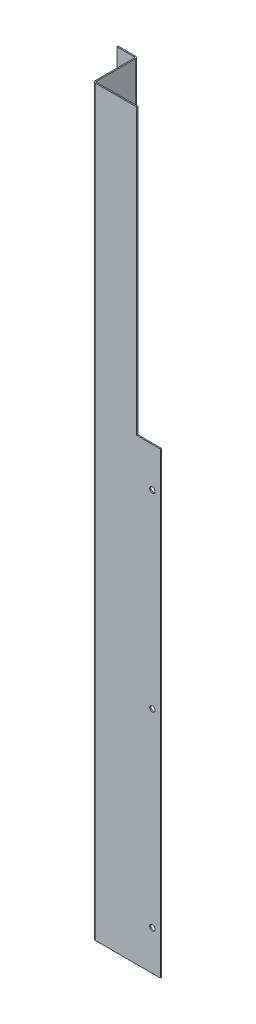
ISO-10303-21;
HEADER;
FILE_DESCRIPTION(('STEP AP214'),'2;1');
FILE_NAME('part.step','',(''),(''),'','','');
FILE_SCHEMA(('AUTOMOTIVE_DESIGN { 1 0 10303 214 1 1 1 1 }'));
ENDSEC;
DATA;
#1=APPLICATION_CONTEXT('core data for automotive mechanical design processes');
#2=APPLICATION_PROTOCOL_DEFINITION('international standard','automotive_design',2000,#1);
#3=PRODUCT_CONTEXT('',#1,'mechanical');
#4=PRODUCT('Part','Part','',(#3));
#5=PRODUCT_RELATED_PRODUCT_CATEGORY('part','',(#4));
#6=PRODUCT_DEFINITION_FORMATION('','',#4);
#7=PRODUCT_DEFINITION_CONTEXT('part definition',#1,'design');
#8=PRODUCT_DEFINITION('design','',#6,#7);
#9=PRODUCT_DEFINITION_SHAPE('','',#8);
#10=(LENGTH_UNIT() NAMED_UNIT(*) SI_UNIT(.MILLI.,.METRE.));
#11=(NAMED_UNIT(*) PLANE_ANGLE_UNIT() SI_UNIT($,.RADIAN.));
#12=(NAMED_UNIT(*) SI_UNIT($,.STERADIAN.) SOLID_ANGLE_UNIT());
#13=UNCERTAINTY_MEASURE_WITH_UNIT(LENGTH_MEASURE(1.E-05),#10,'distance_accuracy_value','');
#14=(GEOMETRIC_REPRESENTATION_CONTEXT(3) GLOBAL_UNCERTAINTY_ASSIGNED_CONTEXT((#13)) GLOBAL_UNIT_ASSIGNED_CONTEXT((#10,
#11,#12)) REPRESENTATION_CONTEXT('',''));
#15=CARTESIAN_POINT('',(0.,0.,0.));
#16=DIRECTION('',(0.,0.,1.));
#17=DIRECTION('',(1.,0.,0.));
#18=AXIS2_PLACEMENT_3D('',#15,#16,#17);
#19=CARTESIAN_POINT('',(25.,940.,925.000000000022));
#20=DIRECTION('',(0.,0.,1.));
#21=DIRECTION('',(-1.,0.,0.));
#22=AXIS2_PLACEMENT_3D('',#19,#20,#21);
#23=PLANE('',#22);
#24=DIRECTION('',(-1.,0.,0.));
#25=VECTOR('',#24,1.);
#26=CARTESIAN_POINT('',(25.,580.,925.000000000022));
#27=LINE('',#26,#25);
#28=CARTESIAN_POINT('',(108.5,580.,925.000000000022));
#29=VERTEX_POINT('',#28);
#30=CARTESIAN_POINT('',(78.5,580.,925.000000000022));
#31=VERTEX_POINT('',#30);
#32=EDGE_CURVE('E778',#29,#31,#27,.T.);
#33=ORIENTED_EDGE('',*,*,#32,.T.);
#34=DIRECTION('',(0.,1.,0.));
#35=VECTOR('',#34,1.);
#36=CARTESIAN_POINT('',(78.5,940.,925.000000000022));
#37=LINE('',#36,#35);
#38=CARTESIAN_POINT('',(78.5,940.,925.000000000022));
#39=VERTEX_POINT('',#38);
#40=EDGE_CURVE('E782',#31,#39,#37,.T.);
#41=ORIENTED_EDGE('',*,*,#40,.T.);
#42=DIRECTION('',(1.,0.,0.));
#43=VECTOR('',#42,1.);
#44=CARTESIAN_POINT('',(25.,940.,925.000000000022));
#45=LINE('',#44,#43);
#46=CARTESIAN_POINT('',(26.5,940.,925.000000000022));
#47=VERTEX_POINT('',#46);
#48=EDGE_CURVE('E138',#47,#39,#45,.T.);
#49=ORIENTED_EDGE('',*,*,#48,.F.);
#50=DIRECTION('',(0.,-1.,0.));
#51=VECTOR('',#50,1.);
#52=CARTESIAN_POINT('',(26.5,940.,925.000000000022));
#53=LINE('',#52,#51);
#54=CARTESIAN_POINT('',(26.5,0.,925.000000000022));
#55=VERTEX_POINT('',#54);
#56=EDGE_CURVE('E230',#47,#55,#53,.T.);
#57=ORIENTED_EDGE('',*,*,#56,.T.);
#58=DIRECTION('',(1.,0.,0.));
#59=VECTOR('',#58,1.);
#60=CARTESIAN_POINT('',(25.,0.,925.000000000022));
#61=LINE('',#60,#59);
#62=CARTESIAN_POINT('',(108.5,0.,925.000000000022));
#63=VERTEX_POINT('',#62);
#64=EDGE_CURVE('E337',#55,#63,#61,.T.);
#65=ORIENTED_EDGE('',*,*,#64,.T.);
#66=DIRECTION('',(0.,-1.,0.));
#67=VECTOR('',#66,1.);
#68=CARTESIAN_POINT('',(108.5,940.,925.000000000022));
#69=LINE('',#68,#67);
#70=EDGE_CURVE('E234',#29,#63,#69,.T.);
#71=ORIENTED_EDGE('',*,*,#70,.F.);
#72=EDGE_LOOP('',(#33,#41,#49,#57,#65,#71));
#73=FACE_BOUND('',#72,.T.);
#74=CARTESIAN_POINT('',(98.5,290.,925.000000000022));
#75=DIRECTION('',(0.,0.,1.));
#76=DIRECTION('',(1.,0.,0.));
#77=AXIS2_PLACEMENT_3D('',#74,#75,#76);
#78=CIRCLE('',#77,3.39999999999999);
#79=CARTESIAN_POINT('',(101.9,290.,925.000000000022));
#80=VERTEX_POINT('',#79);
#81=EDGE_CURVE('E275',#80,#80,#78,.T.);
#82=ORIENTED_EDGE('',*,*,#81,.F.);
#83=EDGE_LOOP('',(#82));
#84=FACE_BOUND('',#83,.T.);
#85=CARTESIAN_POINT('',(98.5,49.9999999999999,925.000000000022));
#86=DIRECTION('',(0.,0.,1.));
#87=DIRECTION('',(1.,0.,0.));
#88=AXIS2_PLACEMENT_3D('',#85,#86,#87);
#89=CIRCLE('',#88,3.39999999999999);
#90=CARTESIAN_POINT('',(101.9,49.9999999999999,925.000000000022));
#91=VERTEX_POINT('',#90);
#92=EDGE_CURVE('E274',#91,#91,#89,.T.);
#93=ORIENTED_EDGE('',*,*,#92,.F.);
#94=EDGE_LOOP('',(#93));
#95=FACE_BOUND('',#94,.T.);
#96=CARTESIAN_POINT('',(98.5,530.,925.000000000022));
#97=DIRECTION('',(0.,0.,1.));
#98=DIRECTION('',(1.,0.,0.));
#99=AXIS2_PLACEMENT_3D('',#96,#97,#98);
#100=CIRCLE('',#99,3.39999999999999);
#101=CARTESIAN_POINT('',(101.9,530.,925.000000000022));
#102=VERTEX_POINT('',#101);
#103=EDGE_CURVE('E279',#102,#102,#100,.T.);
#104=ORIENTED_EDGE('',*,*,#103,.F.);
#105=EDGE_LOOP('',(#104));
#106=FACE_BOUND('',#105,.T.);
#107=ADVANCED_FACE('F38',(#73,#84,#95,#106),#23,.T.);
#108=CARTESIAN_POINT('',(22.,940.,870.000000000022));
#109=DIRECTION('',(0.,1.,0.));
#110=DIRECTION('',(0.,0.,-1.));
#111=AXIS2_PLACEMENT_3D('',#108,#109,#110);
#112=PLANE('',#111);
#113=DIRECTION('',(0.,0.,1.));
#114=VECTOR('',#113,1.);
#115=CARTESIAN_POINT('',(22.,940.,870.000000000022));
#116=LINE('',#115,#114);
#117=CARTESIAN_POINT('',(22.,940.,870.000000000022));
#118=VERTEX_POINT('',#117);
#119=CARTESIAN_POINT('',(22.,940.,871.500000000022));
#120=VERTEX_POINT('',#119);
#121=EDGE_CURVE('E47',#118,#120,#116,.T.);
#122=ORIENTED_EDGE('',*,*,#121,.T.);
#123=CARTESIAN_POINT('',(22.,940.,873.000000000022));
#124=DIRECTION('',(0.,-1.,0.));
#125=DIRECTION('',(1.,0.,0.));
#126=AXIS2_PLACEMENT_3D('',#123,#124,#125);
#127=CIRCLE('',#126,1.5);
#128=CARTESIAN_POINT('',(23.5,940.,873.000000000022));
#129=VERTEX_POINT('',#128);
#130=EDGE_CURVE('E174',#120,#129,#127,.T.);
#131=ORIENTED_EDGE('',*,*,#130,.T.);
#132=DIRECTION('',(1.,0.,0.));
#133=VECTOR('',#132,1.);
#134=CARTESIAN_POINT('',(23.5,940.,873.000000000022));
#135=LINE('',#134,#133);
#136=CARTESIAN_POINT('',(25.,940.,873.000000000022));
#137=VERTEX_POINT('',#136);
#138=EDGE_CURVE('E264',#129,#137,#135,.T.);
#139=ORIENTED_EDGE('',*,*,#138,.T.);
#140=CARTESIAN_POINT('',(22.,940.,873.000000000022));
#141=DIRECTION('',(0.,1.,0.));
#142=DIRECTION('',(0.,0.,1.));
#143=AXIS2_PLACEMENT_3D('',#140,#141,#142);
#144=CIRCLE('',#143,3.);
#145=EDGE_CURVE('E190',#118,#137,#144,.F.);
#146=ORIENTED_EDGE('',*,*,#145,.F.);
#147=EDGE_LOOP('',(#122,#131,#139,#146));
#148=FACE_BOUND('',#147,.T.);
#149=ADVANCED_FACE('F40',(#148),#112,.T.);
#150=CARTESIAN_POINT('',(23.5,940.,873.000000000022));
#151=DIRECTION('',(0.,1.,0.));
#152=DIRECTION('',(0.,0.,-1.));
#153=AXIS2_PLACEMENT_3D('',#150,#151,#152);
#154=PLANE('',#153);
#155=DIRECTION('',(1.,0.,0.));
#156=VECTOR('',#155,1.);
#157=CARTESIAN_POINT('',(0.,940.,870.000000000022));
#158=LINE('',#157,#156);
#159=CARTESIAN_POINT('',(0.,940.,870.000000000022));
#160=VERTEX_POINT('',#159);
#161=EDGE_CURVE('E186',#160,#118,#158,.T.);
#162=ORIENTED_EDGE('',*,*,#161,.F.);
#163=DIRECTION('',(0.,0.,1.));
#164=VECTOR('',#163,1.);
#165=CARTESIAN_POINT('',(0.,940.,870.000000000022));
#166=LINE('',#165,#164);
#167=CARTESIAN_POINT('',(0.,940.,871.500000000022));
#168=VERTEX_POINT('',#167);
#169=EDGE_CURVE('E182',#160,#168,#166,.T.);
#170=ORIENTED_EDGE('',*,*,#169,.T.);
#171=DIRECTION('',(1.,0.,0.));
#172=VECTOR('',#171,1.);
#173=CARTESIAN_POINT('',(0.,940.,871.500000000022));
#174=LINE('',#173,#172);
#175=EDGE_CURVE('E178',#168,#120,#174,.T.);
#176=ORIENTED_EDGE('',*,*,#175,.T.);
#177=ORIENTED_EDGE('',*,*,#121,.F.);
#178=EDGE_LOOP('',(#162,#170,#176,#177));
#179=FACE_BOUND('',#178,.T.);
#180=ADVANCED_FACE('F423',(#179),#154,.T.);
#181=CARTESIAN_POINT('',(25.,0.,873.000000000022));
#182=DIRECTION('',(0.,-1.,0.));
#183=DIRECTION('',(0.,0.,1.));
#184=AXIS2_PLACEMENT_3D('',#181,#182,#183);
#185=PLANE('',#184);
#186=DIRECTION('',(-1.,0.,0.));
#187=VECTOR('',#186,1.);
#188=CARTESIAN_POINT('',(25.,0.,873.000000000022));
#189=LINE('',#188,#187);
#190=CARTESIAN_POINT('',(25.,0.,873.000000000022));
#191=VERTEX_POINT('',#190);
#192=CARTESIAN_POINT('',(23.5,0.,873.000000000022));
#193=VERTEX_POINT('',#192);
#194=EDGE_CURVE('E260',#191,#193,#189,.T.);
#195=ORIENTED_EDGE('',*,*,#194,.T.);
#196=CARTESIAN_POINT('',(22.,0.,873.000000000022));
#197=DIRECTION('',(0.,-1.,0.));
#198=DIRECTION('',(1.,0.,0.));
#199=AXIS2_PLACEMENT_3D('',#196,#197,#198);
#200=CIRCLE('',#199,1.5);
#201=CARTESIAN_POINT('',(22.,0.,871.500000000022));
#202=VERTEX_POINT('',#201);
#203=EDGE_CURVE('E348',#202,#193,#200,.T.);
#204=ORIENTED_EDGE('',*,*,#203,.F.);
#205=DIRECTION('',(0.,0.,-1.));
#206=VECTOR('',#205,1.);
#207=CARTESIAN_POINT('',(22.,0.,871.500000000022));
#208=LINE('',#207,#206);
#209=CARTESIAN_POINT('',(22.,0.,870.000000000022));
#210=VERTEX_POINT('',#209);
#211=EDGE_CURVE('E256',#202,#210,#208,.T.);
#212=ORIENTED_EDGE('',*,*,#211,.T.);
#213=CARTESIAN_POINT('',(22.,0.,873.000000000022));
#214=DIRECTION('',(0.,1.,0.));
#215=DIRECTION('',(0.,0.,1.));
#216=AXIS2_PLACEMENT_3D('',#213,#214,#215);
#217=CIRCLE('',#216,3.);
#218=EDGE_CURVE('E362',#210,#191,#217,.F.);
#219=ORIENTED_EDGE('',*,*,#218,.T.);
#220=EDGE_LOOP('',(#195,#204,#212,#219));
#221=FACE_BOUND('',#220,.T.);
#222=ADVANCED_FACE('F379',(#221),#185,.T.);
#223=CARTESIAN_POINT('',(22.,0.,871.500000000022));
#224=DIRECTION('',(0.,-1.,0.));
#225=DIRECTION('',(0.,0.,1.));
#226=AXIS2_PLACEMENT_3D('',#223,#224,#225);
#227=PLANE('',#226);
#228=DIRECTION('',(0.,0.,1.));
#229=VECTOR('',#228,1.);
#230=CARTESIAN_POINT('',(25.,0.,870.000000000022));
#231=LINE('',#230,#229);
#232=CARTESIAN_POINT('',(25.,0.,922.000000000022));
#233=VERTEX_POINT('',#232);
#234=EDGE_CURVE('E163',#191,#233,#231,.T.);
#235=ORIENTED_EDGE('',*,*,#234,.T.);
#236=DIRECTION('',(1.,0.,0.));
#237=VECTOR('',#236,1.);
#238=CARTESIAN_POINT('',(23.5,0.,922.000000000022));
#239=LINE('',#238,#237);
#240=CARTESIAN_POINT('',(23.5,0.,922.000000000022));
#241=VERTEX_POINT('',#240);
#242=EDGE_CURVE('E241',#241,#233,#239,.T.);
#243=ORIENTED_EDGE('',*,*,#242,.F.);
#244=DIRECTION('',(0.,0.,1.));
#245=VECTOR('',#244,1.);
#246=CARTESIAN_POINT('',(23.5,0.,870.000000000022));
#247=LINE('',#246,#245);
#248=EDGE_CURVE('E344',#193,#241,#247,.T.);
#249=ORIENTED_EDGE('',*,*,#248,.F.);
#250=ORIENTED_EDGE('',*,*,#194,.F.);
#251=EDGE_LOOP('',(#235,#243,#249,#250));
#252=FACE_BOUND('',#251,.T.);
#253=ADVANCED_FACE('F371',(#252),#227,.T.);
#254=CARTESIAN_POINT('',(25.,940.,922.000000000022));
#255=DIRECTION('',(0.,1.,0.));
#256=DIRECTION('',(0.,0.,-1.));
#257=AXIS2_PLACEMENT_3D('',#254,#255,#256);
#258=PLANE('',#257);
#259=DIRECTION('',(-1.,0.,0.));
#260=VECTOR('',#259,1.);
#261=CARTESIAN_POINT('',(25.,940.,922.000000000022));
#262=LINE('',#261,#260);
#263=CARTESIAN_POINT('',(25.,940.,922.000000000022));
#264=VERTEX_POINT('',#263);
#265=CARTESIAN_POINT('',(23.5,940.,922.000000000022));
#266=VERTEX_POINT('',#265);
#267=EDGE_CURVE('E253',#264,#266,#262,.T.);
#268=ORIENTED_EDGE('',*,*,#267,.T.);
#269=CARTESIAN_POINT('',(26.5,940.,922.000000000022));
#270=DIRECTION('',(0.,-1.,0.));
#271=DIRECTION('',(1.,0.,0.));
#272=AXIS2_PLACEMENT_3D('',#269,#270,#271);
#273=CIRCLE('',#272,3.);
#274=EDGE_CURVE('E159',#266,#47,#273,.F.);
#275=ORIENTED_EDGE('',*,*,#274,.T.);
#276=DIRECTION('',(0.,0.,-1.));
#277=VECTOR('',#276,1.);
#278=CARTESIAN_POINT('',(26.5,940.,925.000000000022));
#279=LINE('',#278,#277);
#280=CARTESIAN_POINT('',(26.5,940.,923.500000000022));
#281=VERTEX_POINT('',#280);
#282=EDGE_CURVE('E249',#47,#281,#279,.T.);
#283=ORIENTED_EDGE('',*,*,#282,.T.);
#284=CARTESIAN_POINT('',(26.5,940.,922.000000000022));
#285=DIRECTION('',(0.,-1.,0.));
#286=DIRECTION('',(0.,0.,-1.));
#287=AXIS2_PLACEMENT_3D('',#284,#285,#286);
#288=CIRCLE('',#287,1.5);
#289=EDGE_CURVE('E198',#264,#281,#288,.F.);
#290=ORIENTED_EDGE('',*,*,#289,.F.);
#291=EDGE_LOOP('',(#268,#275,#283,#290));
#292=FACE_BOUND('',#291,.T.);
#293=ADVANCED_FACE('F396',(#292),#258,.T.);
#294=CARTESIAN_POINT('',(26.5,940.,925.000000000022));
#295=DIRECTION('',(0.,1.,0.));
#296=DIRECTION('',(0.,0.,-1.));
#297=AXIS2_PLACEMENT_3D('',#294,#295,#296);
#298=PLANE('',#297);
#299=DIRECTION('',(0.,0.,1.));
#300=VECTOR('',#299,1.);
#301=CARTESIAN_POINT('',(25.,940.,870.000000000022));
#302=LINE('',#301,#300);
#303=EDGE_CURVE('E194',#137,#264,#302,.T.);
#304=ORIENTED_EDGE('',*,*,#303,.F.);
#305=ORIENTED_EDGE('',*,*,#138,.F.);
#306=DIRECTION('',(0.,0.,1.));
#307=VECTOR('',#306,1.);
#308=CARTESIAN_POINT('',(23.5,940.,870.000000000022));
#309=LINE('',#308,#307);
#310=EDGE_CURVE('E170',#129,#266,#309,.T.);
#311=ORIENTED_EDGE('',*,*,#310,.T.);
#312=ORIENTED_EDGE('',*,*,#267,.F.);
#313=EDGE_LOOP('',(#304,#305,#311,#312));
#314=FACE_BOUND('',#313,.T.);
#315=ADVANCED_FACE('F390',(#314),#298,.T.);
#316=CARTESIAN_POINT('',(26.5,0.,923.500000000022));
#317=DIRECTION('',(0.,-1.,0.));
#318=DIRECTION('',(0.,0.,1.));
#319=AXIS2_PLACEMENT_3D('',#316,#317,#318);
#320=PLANE('',#319);
#321=DIRECTION('',(0.,0.,1.));
#322=VECTOR('',#321,1.);
#323=CARTESIAN_POINT('',(26.5,0.,923.500000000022));
#324=LINE('',#323,#322);
#325=CARTESIAN_POINT('',(26.5,0.,923.500000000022));
#326=VERTEX_POINT('',#325);
#327=EDGE_CURVE('E245',#326,#55,#324,.T.);
#328=ORIENTED_EDGE('',*,*,#327,.T.);
#329=CARTESIAN_POINT('',(26.5,0.,922.000000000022));
#330=DIRECTION('',(0.,-1.,0.));
#331=DIRECTION('',(1.,0.,0.));
#332=AXIS2_PLACEMENT_3D('',#329,#330,#331);
#333=CIRCLE('',#332,3.);
#334=EDGE_CURVE('E341',#241,#55,#333,.F.);
#335=ORIENTED_EDGE('',*,*,#334,.F.);
#336=ORIENTED_EDGE('',*,*,#242,.T.);
#337=CARTESIAN_POINT('',(26.5,0.,922.000000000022));
#338=DIRECTION('',(0.,-1.,0.));
#339=DIRECTION('',(0.,0.,-1.));
#340=AXIS2_PLACEMENT_3D('',#337,#338,#339);
#341=CIRCLE('',#340,1.5);
#342=EDGE_CURVE('E155',#233,#326,#341,.F.);
#343=ORIENTED_EDGE('',*,*,#342,.T.);
#344=EDGE_LOOP('',(#328,#335,#336,#343));
#345=FACE_BOUND('',#344,.T.);
#346=ADVANCED_FACE('F402',(#345),#320,.T.);
#347=CARTESIAN_POINT('',(23.5,0.,922.000000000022));
#348=DIRECTION('',(0.,-1.,0.));
#349=DIRECTION('',(0.,0.,1.));
#350=AXIS2_PLACEMENT_3D('',#347,#348,#349);
#351=PLANE('',#350);
#352=DIRECTION('',(1.,0.,0.));
#353=VECTOR('',#352,1.);
#354=CARTESIAN_POINT('',(25.,0.,923.500000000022));
#355=LINE('',#354,#353);
#356=CARTESIAN_POINT('',(108.5,0.,923.500000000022));
#357=VERTEX_POINT('',#356);
#358=EDGE_CURVE('E330',#326,#357,#355,.T.);
#359=ORIENTED_EDGE('',*,*,#358,.T.);
#360=DIRECTION('',(0.,0.,-1.));
#361=VECTOR('',#360,1.);
#362=CARTESIAN_POINT('',(108.5,0.,925.000000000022));
#363=LINE('',#362,#361);
#364=EDGE_CURVE('E334',#63,#357,#363,.T.);
#365=ORIENTED_EDGE('',*,*,#364,.F.);
#366=ORIENTED_EDGE('',*,*,#64,.F.);
#367=ORIENTED_EDGE('',*,*,#327,.F.);
#368=EDGE_LOOP('',(#359,#365,#366,#367));
#369=FACE_BOUND('',#368,.T.);
#370=ADVANCED_FACE('F453',(#369),#351,.T.);
#371=CARTESIAN_POINT('',(25.,940.,923.500000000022));
#372=DIRECTION('',(0.,0.,1.));
#373=DIRECTION('',(-1.,0.,0.));
#374=AXIS2_PLACEMENT_3D('',#371,#372,#373);
#375=PLANE('',#374);
#376=CARTESIAN_POINT('',(98.5,530.,923.500000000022));
#377=DIRECTION('',(0.,0.,-1.));
#378=DIRECTION('',(-1.,0.,0.));
#379=AXIS2_PLACEMENT_3D('',#376,#377,#378);
#380=CIRCLE('',#379,3.39999999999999);
#381=CARTESIAN_POINT('',(95.1000000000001,530.,923.500000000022));
#382=VERTEX_POINT('',#381);
#383=EDGE_CURVE('E276',#382,#382,#380,.T.);
#384=ORIENTED_EDGE('',*,*,#383,.F.);
#385=EDGE_LOOP('',(#384));
#386=FACE_BOUND('',#385,.T.);
#387=CARTESIAN_POINT('',(98.5,290.,923.500000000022));
#388=DIRECTION('',(0.,0.,-1.));
#389=DIRECTION('',(-1.,0.,0.));
#390=AXIS2_PLACEMENT_3D('',#387,#388,#389);
#391=CIRCLE('',#390,3.39999999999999);
#392=CARTESIAN_POINT('',(95.1000000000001,290.,923.500000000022));
#393=VERTEX_POINT('',#392);
#394=EDGE_CURVE('E271',#393,#393,#391,.T.);
#395=ORIENTED_EDGE('',*,*,#394,.F.);
#396=EDGE_LOOP('',(#395));
#397=FACE_BOUND('',#396,.T.);
#398=CARTESIAN_POINT('',(98.5,49.9999999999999,923.500000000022));
#399=DIRECTION('',(0.,0.,-1.));
#400=DIRECTION('',(-1.,0.,0.));
#401=AXIS2_PLACEMENT_3D('',#398,#399,#400);
#402=CIRCLE('',#401,3.39999999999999);
#403=CARTESIAN_POINT('',(95.1,49.9999999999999,923.500000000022));
#404=VERTEX_POINT('',#403);
#405=EDGE_CURVE('E302',#404,#404,#402,.T.);
#406=ORIENTED_EDGE('',*,*,#405,.F.);
#407=EDGE_LOOP('',(#406));
#408=FACE_BOUND('',#407,.T.);
#409=DIRECTION('',(0.,-1.,0.));
#410=VECTOR('',#409,1.);
#411=CARTESIAN_POINT('',(108.5,940.,923.500000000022));
#412=LINE('',#411,#410);
#413=CARTESIAN_POINT('',(108.5,580.,923.500000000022));
#414=VERTEX_POINT('',#413);
#415=EDGE_CURVE('E238',#414,#357,#412,.T.);
#416=ORIENTED_EDGE('',*,*,#415,.T.);
#417=ORIENTED_EDGE('',*,*,#358,.F.);
#418=DIRECTION('',(0.,-1.,0.));
#419=VECTOR('',#418,1.);
#420=CARTESIAN_POINT('',(26.5,940.,923.500000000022));
#421=LINE('',#420,#419);
#422=EDGE_CURVE('E152',#281,#326,#421,.T.);
#423=ORIENTED_EDGE('',*,*,#422,.F.);
#424=DIRECTION('',(1.,0.,0.));
#425=VECTOR('',#424,1.);
#426=CARTESIAN_POINT('',(25.,940.,923.500000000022));
#427=LINE('',#426,#425);
#428=CARTESIAN_POINT('',(78.5,940.,923.500000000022));
#429=VERTEX_POINT('',#428);
#430=EDGE_CURVE('E59',#281,#429,#427,.T.);
#431=ORIENTED_EDGE('',*,*,#430,.T.);
#432=DIRECTION('',(0.,-1.,0.));
#433=VECTOR('',#432,1.);
#434=CARTESIAN_POINT('',(78.5,580.,923.500000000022));
#435=LINE('',#434,#433);
#436=CARTESIAN_POINT('',(78.5,580.,923.500000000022));
#437=VERTEX_POINT('',#436);
#438=EDGE_CURVE('E141',#429,#437,#435,.T.);
#439=ORIENTED_EDGE('',*,*,#438,.T.);
#440=DIRECTION('',(1.,0.,0.));
#441=VECTOR('',#440,1.);
#442=CARTESIAN_POINT('',(108.5,580.,923.500000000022));
#443=LINE('',#442,#441);
#444=EDGE_CURVE('E148',#437,#414,#443,.T.);
#445=ORIENTED_EDGE('',*,*,#444,.T.);
#446=EDGE_LOOP('',(#416,#417,#423,#431,#439,#445));
#447=FACE_BOUND('',#446,.T.);
#448=ADVANCED_FACE('F150',(#386,#397,#408,#447),#375,.F.);
#449=CARTESIAN_POINT('',(108.5,940.,925.000000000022));
#450=DIRECTION('',(1.,0.,0.));
#451=DIRECTION('',(0.,0.,1.));
#452=AXIS2_PLACEMENT_3D('',#449,#450,#451);
#453=PLANE('',#452);
#454=DIRECTION('',(0.,0.,-1.));
#455=VECTOR('',#454,1.);
#456=CARTESIAN_POINT('',(108.5,580.,933.500000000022));
#457=LINE('',#456,#455);
#458=EDGE_CURVE('E779',#29,#414,#457,.T.);
#459=ORIENTED_EDGE('',*,*,#458,.F.);
#460=ORIENTED_EDGE('',*,*,#70,.T.);
#461=ORIENTED_EDGE('',*,*,#364,.T.);
#462=ORIENTED_EDGE('',*,*,#415,.F.);
#463=EDGE_LOOP('',(#459,#460,#461,#462));
#464=FACE_BOUND('',#463,.T.);
#465=ADVANCED_FACE('F447',(#464),#453,.T.);
#466=CARTESIAN_POINT('',(26.5,940.,922.000000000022));
#467=DIRECTION('',(0.,-1.,0.));
#468=DIRECTION('',(0.,0.,1.));
#469=AXIS2_PLACEMENT_3D('',#466,#467,#468);
#470=CYLINDRICAL_SURFACE('',#469,3.);
#471=ORIENTED_EDGE('',*,*,#334,.T.);
#472=ORIENTED_EDGE('',*,*,#56,.F.);
#473=ORIENTED_EDGE('',*,*,#274,.F.);
#474=DIRECTION('',(0.,-1.,0.));
#475=VECTOR('',#474,1.);
#476=CARTESIAN_POINT('',(23.5,940.,922.000000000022));
#477=LINE('',#476,#475);
#478=EDGE_CURVE('E227',#266,#241,#477,.T.);
#479=ORIENTED_EDGE('',*,*,#478,.T.);
#480=EDGE_LOOP('',(#471,#472,#473,#479));
#481=FACE_BOUND('',#480,.T.);
#482=ADVANCED_FACE('F445',(#481),#470,.T.);
#483=CARTESIAN_POINT('',(23.5,940.,870.000000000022));
#484=DIRECTION('',(-1.,0.,0.));
#485=DIRECTION('',(0.,0.,-1.));
#486=AXIS2_PLACEMENT_3D('',#483,#484,#485);
#487=PLANE('',#486);
#488=ORIENTED_EDGE('',*,*,#248,.T.);
#489=ORIENTED_EDGE('',*,*,#478,.F.);
#490=ORIENTED_EDGE('',*,*,#310,.F.);
#491=DIRECTION('',(0.,-1.,0.));
#492=VECTOR('',#491,1.);
#493=CARTESIAN_POINT('',(23.5,940.,873.000000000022));
#494=LINE('',#493,#492);
#495=EDGE_CURVE('E224',#129,#193,#494,.T.);
#496=ORIENTED_EDGE('',*,*,#495,.T.);
#497=EDGE_LOOP('',(#488,#489,#490,#496));
#498=FACE_BOUND('',#497,.T.);
#499=ADVANCED_FACE('F407',(#498),#487,.T.);
#500=CARTESIAN_POINT('',(22.,940.,873.000000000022));
#501=DIRECTION('',(0.,-1.,0.));
#502=DIRECTION('',(0.,0.,1.));
#503=AXIS2_PLACEMENT_3D('',#500,#501,#502);
#504=CYLINDRICAL_SURFACE('',#503,1.5);
#505=ORIENTED_EDGE('',*,*,#203,.T.);
#506=ORIENTED_EDGE('',*,*,#495,.F.);
#507=ORIENTED_EDGE('',*,*,#130,.F.);
#508=DIRECTION('',(0.,-1.,0.));
#509=VECTOR('',#508,1.);
#510=CARTESIAN_POINT('',(22.,940.,871.500000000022));
#511=LINE('',#510,#509);
#512=EDGE_CURVE('E220',#120,#202,#511,.T.);
#513=ORIENTED_EDGE('',*,*,#512,.T.);
#514=EDGE_LOOP('',(#505,#506,#507,#513));
#515=FACE_BOUND('',#514,.T.);
#516=ADVANCED_FACE('F409',(#515),#504,.F.);
#517=CARTESIAN_POINT('',(0.,940.,871.500000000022));
#518=DIRECTION('',(0.,0.,1.));
#519=DIRECTION('',(-1.,0.,0.));
#520=AXIS2_PLACEMENT_3D('',#517,#518,#519);
#521=PLANE('',#520);
#522=CARTESIAN_POINT('',(10.,610.,871.500000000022));
#523=DIRECTION('',(0.,0.,-1.));
#524=DIRECTION('',(-1.,0.,0.));
#525=AXIS2_PLACEMENT_3D('',#522,#523,#524);
#526=CIRCLE('',#525,3.39999999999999);
#527=CARTESIAN_POINT('',(6.60000000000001,610.,871.500000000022));
#528=VERTEX_POINT('',#527);
#529=EDGE_CURVE('E289',#528,#528,#526,.T.);
#530=ORIENTED_EDGE('',*,*,#529,.T.);
#531=EDGE_LOOP('',(#530));
#532=FACE_BOUND('',#531,.T.);
#533=CARTESIAN_POINT('',(10.,50.,871.500000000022));
#534=DIRECTION('',(0.,0.,-1.));
#535=DIRECTION('',(-1.,0.,0.));
#536=AXIS2_PLACEMENT_3D('',#533,#534,#535);
#537=CIRCLE('',#536,3.39999999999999);
#538=CARTESIAN_POINT('',(6.60000000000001,50.,871.500000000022));
#539=VERTEX_POINT('',#538);
#540=EDGE_CURVE('E310',#539,#539,#537,.T.);
#541=ORIENTED_EDGE('',*,*,#540,.T.);
#542=EDGE_LOOP('',(#541));
#543=FACE_BOUND('',#542,.T.);
#544=CARTESIAN_POINT('',(10.,330.,871.500000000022));
#545=DIRECTION('',(0.,0.,-1.));
#546=DIRECTION('',(-1.,0.,0.));
#547=AXIS2_PLACEMENT_3D('',#544,#545,#546);
#548=CIRCLE('',#547,3.39999999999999);
#549=CARTESIAN_POINT('',(6.60000000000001,330.,871.500000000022));
#550=VERTEX_POINT('',#549);
#551=EDGE_CURVE('E318',#550,#550,#548,.T.);
#552=ORIENTED_EDGE('',*,*,#551,.T.);
#553=EDGE_LOOP('',(#552));
#554=FACE_BOUND('',#553,.T.);
#555=CARTESIAN_POINT('',(10.,890.,871.500000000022));
#556=DIRECTION('',(0.,0.,-1.));
#557=DIRECTION('',(-1.,0.,0.));
#558=AXIS2_PLACEMENT_3D('',#555,#556,#557);
#559=CIRCLE('',#558,3.39999999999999);
#560=CARTESIAN_POINT('',(6.60000000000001,890.,871.500000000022));
#561=VERTEX_POINT('',#560);
#562=EDGE_CURVE('E326',#561,#561,#559,.T.);
#563=ORIENTED_EDGE('',*,*,#562,.T.);
#564=EDGE_LOOP('',(#563));
#565=FACE_BOUND('',#564,.T.);
#566=DIRECTION('',(1.,0.,0.));
#567=VECTOR('',#566,1.);
#568=CARTESIAN_POINT('',(0.,0.,871.500000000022));
#569=LINE('',#568,#567);
#570=CARTESIAN_POINT('',(0.,0.,871.500000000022));
#571=VERTEX_POINT('',#570);
#572=EDGE_CURVE('E352',#571,#202,#569,.T.);
#573=ORIENTED_EDGE('',*,*,#572,.T.);
#574=ORIENTED_EDGE('',*,*,#512,.F.);
#575=ORIENTED_EDGE('',*,*,#175,.F.);
#576=DIRECTION('',(0.,-1.,0.));
#577=VECTOR('',#576,1.);
#578=CARTESIAN_POINT('',(0.,940.,871.500000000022));
#579=LINE('',#578,#577);
#580=EDGE_CURVE('E216',#168,#571,#579,.T.);
#581=ORIENTED_EDGE('',*,*,#580,.T.);
#582=EDGE_LOOP('',(#573,#574,#575,#581));
#583=FACE_BOUND('',#582,.T.);
#584=ADVANCED_FACE('F424',(#532,#543,#554,#565,#583),#521,.T.);
#585=CARTESIAN_POINT('',(0.,940.,870.000000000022));
#586=DIRECTION('',(-1.,0.,0.));
#587=DIRECTION('',(0.,0.,-1.));
#588=AXIS2_PLACEMENT_3D('',#585,#586,#587);
#589=PLANE('',#588);
#590=DIRECTION('',(0.,0.,1.));
#591=VECTOR('',#590,1.);
#592=CARTESIAN_POINT('',(0.,0.,870.000000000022));
#593=LINE('',#592,#591);
#594=CARTESIAN_POINT('',(0.,0.,870.000000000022));
#595=VERTEX_POINT('',#594);
#596=EDGE_CURVE('E355',#595,#571,#593,.T.);
#597=ORIENTED_EDGE('',*,*,#596,.T.);
#598=ORIENTED_EDGE('',*,*,#580,.F.);
#599=ORIENTED_EDGE('',*,*,#169,.F.);
#600=DIRECTION('',(0.,-1.,0.));
#601=VECTOR('',#600,1.);
#602=CARTESIAN_POINT('',(0.,940.,870.000000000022));
#603=LINE('',#602,#601);
#604=EDGE_CURVE('E212',#160,#595,#603,.T.);
#605=ORIENTED_EDGE('',*,*,#604,.T.);
#606=EDGE_LOOP('',(#597,#598,#599,#605));
#607=FACE_BOUND('',#606,.T.);
#608=ADVANCED_FACE('F420',(#607),#589,.T.);
#609=CARTESIAN_POINT('',(0.,940.,870.000000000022));
#610=DIRECTION('',(0.,0.,1.));
#611=DIRECTION('',(-1.,0.,0.));
#612=AXIS2_PLACEMENT_3D('',#609,#610,#611);
#613=PLANE('',#612);
#614=CARTESIAN_POINT('',(10.,610.,870.000000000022));
#615=DIRECTION('',(0.,0.,1.));
#616=DIRECTION('',(1.,0.,0.));
#617=AXIS2_PLACEMENT_3D('',#614,#615,#616);
#618=CIRCLE('',#617,3.39999999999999);
#619=CARTESIAN_POINT('',(13.4,610.,870.000000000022));
#620=VERTEX_POINT('',#619);
#621=EDGE_CURVE('E295',#620,#620,#618,.T.);
#622=ORIENTED_EDGE('',*,*,#621,.T.);
#623=EDGE_LOOP('',(#622));
#624=FACE_BOUND('',#623,.T.);
#625=CARTESIAN_POINT('',(10.,50.,870.000000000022));
#626=DIRECTION('',(0.,0.,1.));
#627=DIRECTION('',(1.,0.,0.));
#628=AXIS2_PLACEMENT_3D('',#625,#626,#627);
#629=CIRCLE('',#628,3.39999999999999);
#630=CARTESIAN_POINT('',(13.4,50.,870.000000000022));
#631=VERTEX_POINT('',#630);
#632=EDGE_CURVE('E306',#631,#631,#629,.T.);
#633=ORIENTED_EDGE('',*,*,#632,.T.);
#634=EDGE_LOOP('',(#633));
#635=FACE_BOUND('',#634,.T.);
#636=CARTESIAN_POINT('',(10.,330.,870.000000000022));
#637=DIRECTION('',(0.,0.,1.));
#638=DIRECTION('',(1.,0.,0.));
#639=AXIS2_PLACEMENT_3D('',#636,#637,#638);
#640=CIRCLE('',#639,3.39999999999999);
#641=CARTESIAN_POINT('',(13.4,330.,870.000000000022));
#642=VERTEX_POINT('',#641);
#643=EDGE_CURVE('E314',#642,#642,#640,.T.);
#644=ORIENTED_EDGE('',*,*,#643,.T.);
#645=EDGE_LOOP('',(#644));
#646=FACE_BOUND('',#645,.T.);
#647=CARTESIAN_POINT('',(10.,890.,870.000000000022));
#648=DIRECTION('',(0.,0.,1.));
#649=DIRECTION('',(1.,0.,0.));
#650=AXIS2_PLACEMENT_3D('',#647,#648,#649);
#651=CIRCLE('',#650,3.39999999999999);
#652=CARTESIAN_POINT('',(13.4,890.,870.000000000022));
#653=VERTEX_POINT('',#652);
#654=EDGE_CURVE('E322',#653,#653,#651,.T.);
#655=ORIENTED_EDGE('',*,*,#654,.T.);
#656=EDGE_LOOP('',(#655));
#657=FACE_BOUND('',#656,.T.);
#658=DIRECTION('',(1.,0.,0.));
#659=VECTOR('',#658,1.);
#660=CARTESIAN_POINT('',(0.,0.,870.000000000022));
#661=LINE('',#660,#659);
#662=EDGE_CURVE('E358',#595,#210,#661,.T.);
#663=ORIENTED_EDGE('',*,*,#662,.F.);
#664=ORIENTED_EDGE('',*,*,#604,.F.);
#665=ORIENTED_EDGE('',*,*,#161,.T.);
#666=DIRECTION('',(0.,-1.,0.));
#667=VECTOR('',#666,1.);
#668=CARTESIAN_POINT('',(22.,940.,870.000000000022));
#669=LINE('',#668,#667);
#670=EDGE_CURVE('E209',#118,#210,#669,.T.);
#671=ORIENTED_EDGE('',*,*,#670,.T.);
#672=EDGE_LOOP('',(#663,#664,#665,#671));
#673=FACE_BOUND('',#672,.T.);
#674=ADVANCED_FACE('F417',(#624,#635,#646,#657,#673),#613,.F.);
#675=CARTESIAN_POINT('',(22.,940.,873.000000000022));
#676=DIRECTION('',(0.,-1.,0.));
#677=DIRECTION('',(0.,0.,1.));
#678=AXIS2_PLACEMENT_3D('',#675,#676,#677);
#679=CYLINDRICAL_SURFACE('',#678,3.);
#680=ORIENTED_EDGE('',*,*,#218,.F.);
#681=ORIENTED_EDGE('',*,*,#670,.F.);
#682=ORIENTED_EDGE('',*,*,#145,.T.);
#683=DIRECTION('',(0.,-1.,0.));
#684=VECTOR('',#683,1.);
#685=CARTESIAN_POINT('',(25.,940.,873.000000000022));
#686=LINE('',#685,#684);
#687=EDGE_CURVE('E206',#137,#191,#686,.T.);
#688=ORIENTED_EDGE('',*,*,#687,.T.);
#689=EDGE_LOOP('',(#680,#681,#682,#688));
#690=FACE_BOUND('',#689,.T.);
#691=ADVANCED_FACE('F383',(#690),#679,.T.);
#692=CARTESIAN_POINT('',(25.,940.,870.000000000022));
#693=DIRECTION('',(-1.,0.,0.));
#694=DIRECTION('',(0.,0.,-1.));
#695=AXIS2_PLACEMENT_3D('',#692,#693,#694);
#696=PLANE('',#695);
#697=ORIENTED_EDGE('',*,*,#234,.F.);
#698=ORIENTED_EDGE('',*,*,#687,.F.);
#699=ORIENTED_EDGE('',*,*,#303,.T.);
#700=DIRECTION('',(0.,-1.,0.));
#701=VECTOR('',#700,1.);
#702=CARTESIAN_POINT('',(25.,940.,922.000000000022));
#703=LINE('',#702,#701);
#704=EDGE_CURVE('E203',#264,#233,#703,.T.);
#705=ORIENTED_EDGE('',*,*,#704,.T.);
#706=EDGE_LOOP('',(#697,#698,#699,#705));
#707=FACE_BOUND('',#706,.T.);
#708=ADVANCED_FACE('F374',(#707),#696,.F.);
#709=CARTESIAN_POINT('',(26.5,940.,922.000000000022));
#710=DIRECTION('',(0.,-1.,0.));
#711=DIRECTION('',(0.,0.,1.));
#712=AXIS2_PLACEMENT_3D('',#709,#710,#711);
#713=CYLINDRICAL_SURFACE('',#712,1.5);
#714=ORIENTED_EDGE('',*,*,#342,.F.);
#715=ORIENTED_EDGE('',*,*,#704,.F.);
#716=ORIENTED_EDGE('',*,*,#289,.T.);
#717=ORIENTED_EDGE('',*,*,#422,.T.);
#718=EDGE_LOOP('',(#714,#715,#716,#717));
#719=FACE_BOUND('',#718,.T.);
#720=ADVANCED_FACE('F398',(#719),#713,.F.);
#721=CARTESIAN_POINT('',(26.5,940.,922.000000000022));
#722=DIRECTION('',(0.,1.,0.));
#723=DIRECTION('',(0.,0.,-1.));
#724=AXIS2_PLACEMENT_3D('',#721,#722,#723);
#725=PLANE('',#724);
#726=DIRECTION('',(0.,0.,-1.));
#727=VECTOR('',#726,1.);
#728=CARTESIAN_POINT('',(78.5,940.,922.000000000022));
#729=LINE('',#728,#727);
#730=EDGE_CURVE('E11',#39,#429,#729,.T.);
#731=ORIENTED_EDGE('',*,*,#730,.T.);
#732=ORIENTED_EDGE('',*,*,#430,.F.);
#733=ORIENTED_EDGE('',*,*,#282,.F.);
#734=ORIENTED_EDGE('',*,*,#48,.T.);
#735=EDGE_LOOP('',(#731,#732,#733,#734));
#736=FACE_BOUND('',#735,.T.);
#737=ADVANCED_FACE('F136',(#736),#725,.T.);
#738=CARTESIAN_POINT('',(26.5,0.,922.000000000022));
#739=DIRECTION('',(0.,1.,0.));
#740=DIRECTION('',(0.,0.,-1.));
#741=AXIS2_PLACEMENT_3D('',#738,#739,#740);
#742=PLANE('',#741);
#743=ORIENTED_EDGE('',*,*,#572,.F.);
#744=ORIENTED_EDGE('',*,*,#596,.F.);
#745=ORIENTED_EDGE('',*,*,#662,.T.);
#746=ORIENTED_EDGE('',*,*,#211,.F.);
#747=EDGE_LOOP('',(#743,#744,#745,#746));
#748=FACE_BOUND('',#747,.T.);
#749=ADVANCED_FACE('F414',(#748),#742,.F.);
#750=CARTESIAN_POINT('',(10.,890.,870.000000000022));
#751=DIRECTION('',(0.,0.,-1.));
#752=DIRECTION('',(1.,0.,0.));
#753=AXIS2_PLACEMENT_3D('',#750,#751,#752);
#754=CYLINDRICAL_SURFACE('',#753,3.39999999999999);
#755=ORIENTED_EDGE('',*,*,#562,.F.);
#756=EDGE_LOOP('',(#755));
#757=FACE_BOUND('',#756,.T.);
#758=ORIENTED_EDGE('',*,*,#654,.F.);
#759=EDGE_LOOP('',(#758));
#760=FACE_BOUND('',#759,.T.);
#761=ADVANCED_FACE('F558',(#757,#760),#754,.F.);
#762=CARTESIAN_POINT('',(10.,330.,870.000000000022));
#763=DIRECTION('',(0.,0.,-1.));
#764=DIRECTION('',(1.,0.,0.));
#765=AXIS2_PLACEMENT_3D('',#762,#763,#764);
#766=CYLINDRICAL_SURFACE('',#765,3.39999999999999);
#767=ORIENTED_EDGE('',*,*,#551,.F.);
#768=EDGE_LOOP('',(#767));
#769=FACE_BOUND('',#768,.T.);
#770=ORIENTED_EDGE('',*,*,#643,.F.);
#771=EDGE_LOOP('',(#770));
#772=FACE_BOUND('',#771,.T.);
#773=ADVANCED_FACE('F566',(#769,#772),#766,.F.);
#774=CARTESIAN_POINT('',(10.,50.,870.000000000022));
#775=DIRECTION('',(0.,0.,-1.));
#776=DIRECTION('',(1.,0.,0.));
#777=AXIS2_PLACEMENT_3D('',#774,#775,#776);
#778=CYLINDRICAL_SURFACE('',#777,3.39999999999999);
#779=ORIENTED_EDGE('',*,*,#540,.F.);
#780=EDGE_LOOP('',(#779));
#781=FACE_BOUND('',#780,.T.);
#782=ORIENTED_EDGE('',*,*,#632,.F.);
#783=EDGE_LOOP('',(#782));
#784=FACE_BOUND('',#783,.T.);
#785=ADVANCED_FACE('F575',(#781,#784),#778,.F.);
#786=CARTESIAN_POINT('',(98.5,49.9999999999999,870.000000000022));
#787=DIRECTION('',(0.,0.,-1.));
#788=DIRECTION('',(1.,0.,0.));
#789=AXIS2_PLACEMENT_3D('',#786,#787,#788);
#790=CYLINDRICAL_SURFACE('',#789,3.39999999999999);
#791=ORIENTED_EDGE('',*,*,#92,.T.);
#792=EDGE_LOOP('',(#791));
#793=FACE_BOUND('',#792,.T.);
#794=ORIENTED_EDGE('',*,*,#405,.T.);
#795=EDGE_LOOP('',(#794));
#796=FACE_BOUND('',#795,.T.);
#797=ADVANCED_FACE('F584',(#793,#796),#790,.F.);
#798=CARTESIAN_POINT('',(98.5,290.,870.000000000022));
#799=DIRECTION('',(0.,0.,-1.));
#800=DIRECTION('',(1.,0.,0.));
#801=AXIS2_PLACEMENT_3D('',#798,#799,#800);
#802=CYLINDRICAL_SURFACE('',#801,3.39999999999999);
#803=ORIENTED_EDGE('',*,*,#81,.T.);
#804=EDGE_LOOP('',(#803));
#805=FACE_BOUND('',#804,.T.);
#806=ORIENTED_EDGE('',*,*,#394,.T.);
#807=EDGE_LOOP('',(#806));
#808=FACE_BOUND('',#807,.T.);
#809=ADVANCED_FACE('F593',(#805,#808),#802,.F.);
#810=CARTESIAN_POINT('',(98.5,530.,870.000000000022));
#811=DIRECTION('',(0.,0.,-1.));
#812=DIRECTION('',(1.,0.,0.));
#813=AXIS2_PLACEMENT_3D('',#810,#811,#812);
#814=CYLINDRICAL_SURFACE('',#813,3.39999999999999);
#815=ORIENTED_EDGE('',*,*,#103,.T.);
#816=EDGE_LOOP('',(#815));
#817=FACE_BOUND('',#816,.T.);
#818=ORIENTED_EDGE('',*,*,#383,.T.);
#819=EDGE_LOOP('',(#818));
#820=FACE_BOUND('',#819,.T.);
#821=ADVANCED_FACE('F602',(#817,#820),#814,.F.);
#822=CARTESIAN_POINT('',(10.,610.,870.000000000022));
#823=DIRECTION('',(0.,0.,-1.));
#824=DIRECTION('',(1.,0.,0.));
#825=AXIS2_PLACEMENT_3D('',#822,#823,#824);
#826=CYLINDRICAL_SURFACE('',#825,3.39999999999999);
#827=ORIENTED_EDGE('',*,*,#529,.F.);
#828=EDGE_LOOP('',(#827));
#829=FACE_BOUND('',#828,.T.);
#830=ORIENTED_EDGE('',*,*,#621,.F.);
#831=EDGE_LOOP('',(#830));
#832=FACE_BOUND('',#831,.T.);
#833=ADVANCED_FACE('F611',(#829,#832),#826,.F.);
#834=CARTESIAN_POINT('',(108.5,580.,933.500000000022));
#835=DIRECTION('',(0.,-1.,0.));
#836=DIRECTION('',(0.,0.,1.));
#837=AXIS2_PLACEMENT_3D('',#834,#835,#836);
#838=PLANE('',#837);
#839=ORIENTED_EDGE('',*,*,#32,.F.);
#840=ORIENTED_EDGE('',*,*,#458,.T.);
#841=ORIENTED_EDGE('',*,*,#444,.F.);
#842=DIRECTION('',(0.,0.,-1.));
#843=VECTOR('',#842,1.);
#844=CARTESIAN_POINT('',(78.5,580.,933.500000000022));
#845=LINE('',#844,#843);
#846=EDGE_CURVE('E143',#31,#437,#845,.T.);
#847=ORIENTED_EDGE('',*,*,#846,.F.);
#848=EDGE_LOOP('',(#839,#840,#841,#847));
#849=FACE_BOUND('',#848,.T.);
#850=ADVANCED_FACE('F619',(#849),#838,.F.);
#851=CARTESIAN_POINT('',(78.5,580.,933.500000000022));
#852=DIRECTION('',(-1.,0.,0.));
#853=DIRECTION('',(0.,0.,-1.));
#854=AXIS2_PLACEMENT_3D('',#851,#852,#853);
#855=PLANE('',#854);
#856=ORIENTED_EDGE('',*,*,#40,.F.);
#857=ORIENTED_EDGE('',*,*,#846,.T.);
#858=ORIENTED_EDGE('',*,*,#438,.F.);
#859=ORIENTED_EDGE('',*,*,#730,.F.);
#860=EDGE_LOOP('',(#856,#857,#858,#859));
#861=FACE_BOUND('',#860,.T.);
#862=ADVANCED_FACE('F142',(#861),#855,.F.);
#863=CLOSED_SHELL('',(#107,#149,#180,#222,#253,#293,#315,#346,#370,#448,#465,#482,#499,#516,
#584,#608,#674,#691,#708,#720,#737,#749,#761,#773,#785,#797,#809,#821,#833,#850,#862));
#864=MANIFOLD_SOLID_BREP('B2',#863);
#865=ADVANCED_BREP_SHAPE_REPRESENTATION('',(#18,#864),#14);
#866=SHAPE_DEFINITION_REPRESENTATION(#9,#865);
ENDSEC;
END-ISO-10303-21;
